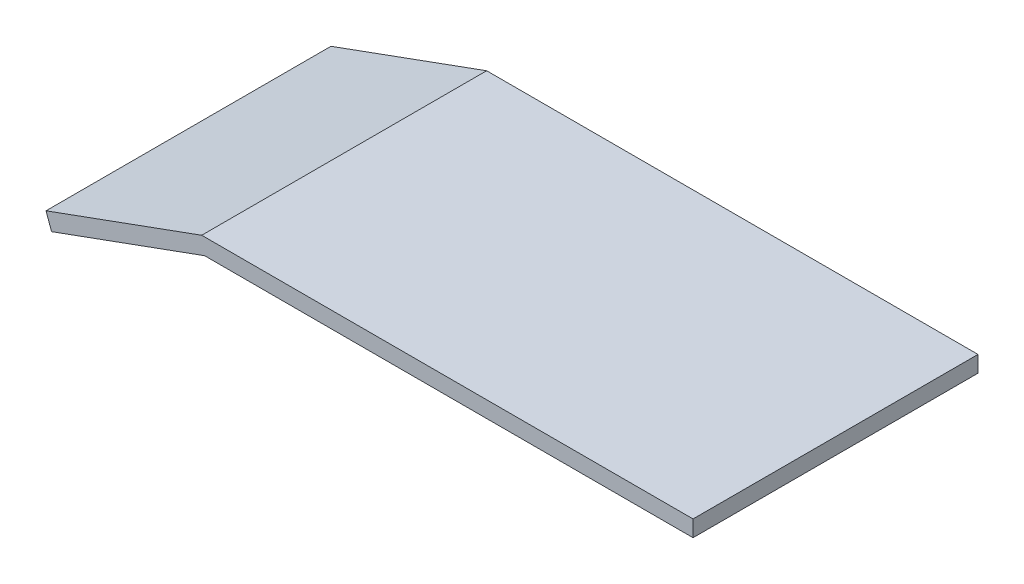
from build123d import *

# Parameters (mm, degrees)
LINEAR_AUSTRAGEN_D_NN1_DEPTH = 35


with BuildPart() as part:
    # Skizze1 → Linear-Austragen-D_nn1 (new body)
    with BuildSketch(Plane.XY):
        Polygon((40.996116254, 20.07311828), (-19.003883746, 20.07311828), (-37.797736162, 13.232715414), (-38.481776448, 15.112100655), (-19.356537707, 22.07311828), (40.996116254, 22.07311828), align=None)
    extrude(amount=-LINEAR_AUSTRAGEN_D_NN1_DEPTH)


solid = part.part
